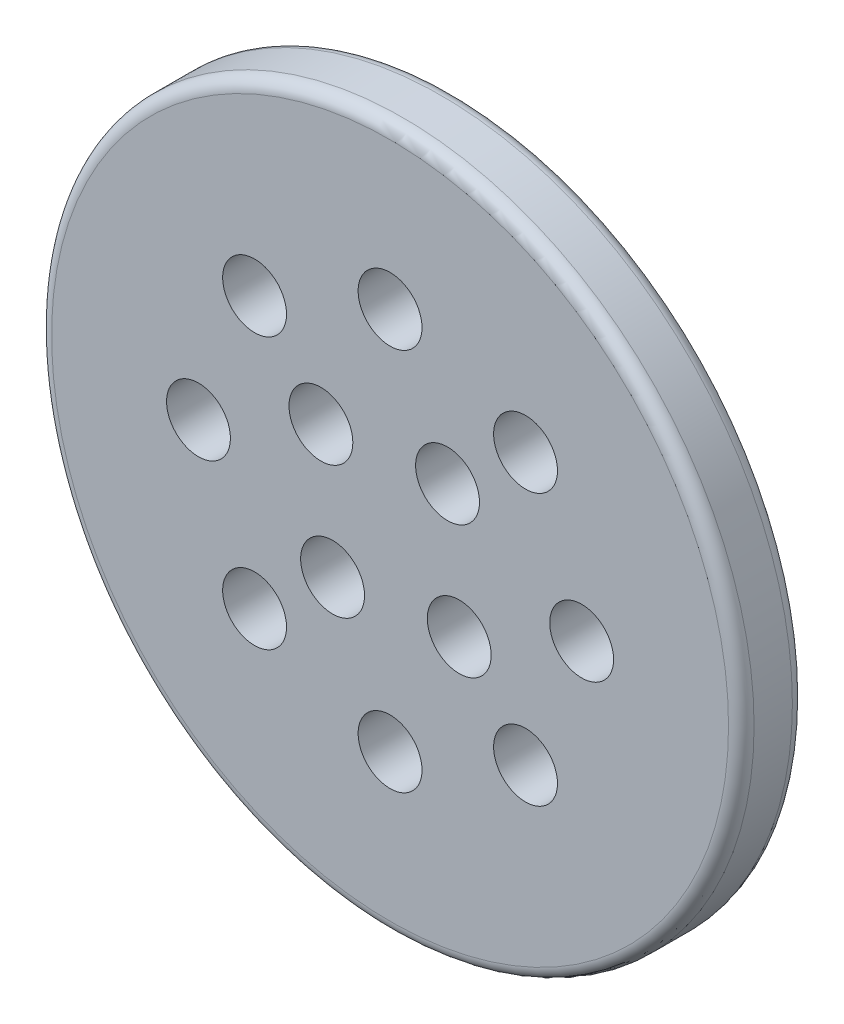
from build123d import *

# Parameters (mm, degrees)
SKETCH1_R           = 275
SKETCH1_R_2         = 25
BOSS_EXTRUDE1_DEPTH = 50
FILLET1_R           = 10
FILLET2_R           = 10


with BuildPart() as part:
    # Sketch1 → Boss-Extrude1 (new body)
    with BuildSketch(Plane.XY):
        Circle(SKETCH1_R)
        with Locations((0, 150)):
            Circle(SKETCH1_R_2, mode=Mode.SUBTRACT)
        with Locations((106.066017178, 106.066017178)):
            Circle(SKETCH1_R_2, mode=Mode.SUBTRACT)
        with Locations((150, 0)):
            Circle(SKETCH1_R_2, mode=Mode.SUBTRACT)
        with Locations((106.066017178, -106.066017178)):
            Circle(SKETCH1_R_2, mode=Mode.SUBTRACT)
        with Locations((0, -150)):
            Circle(SKETCH1_R_2, mode=Mode.SUBTRACT)
        with Locations((-106.066017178, -106.066017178)):
            Circle(SKETCH1_R_2, mode=Mode.SUBTRACT)
        with Locations((-150, 0)):
            Circle(SKETCH1_R_2, mode=Mode.SUBTRACT)
        with Locations((-106.066017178, 106.066017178)):
            Circle(SKETCH1_R_2, mode=Mode.SUBTRACT)
        with Locations((-54.151001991, 45)):
            Circle(SKETCH1_R_2, mode=Mode.SUBTRACT)
        with Locations((45, 54.151001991)):
            Circle(SKETCH1_R_2, mode=Mode.SUBTRACT)
        with Locations((54.151001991, -45)):
            Circle(SKETCH1_R_2, mode=Mode.SUBTRACT)
        with Locations((-45, -54.151001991)):
            Circle(SKETCH1_R_2, mode=Mode.SUBTRACT)
    extrude(amount=BOSS_EXTRUDE1_DEPTH)

    # Fillet1
    fillet1_edges = [part.edges().sort_by_distance(p)[0] for p in [
        (-275, 0, 50),
    ]]
    fillet(fillet1_edges, radius=FILLET1_R)

    # Fillet2
    fillet2_edges = [part.edges().sort_by_distance(p)[0] for p in [
        (-275, 0, 0),
    ]]
    fillet(fillet2_edges, radius=FILLET2_R)


solid = part.part
